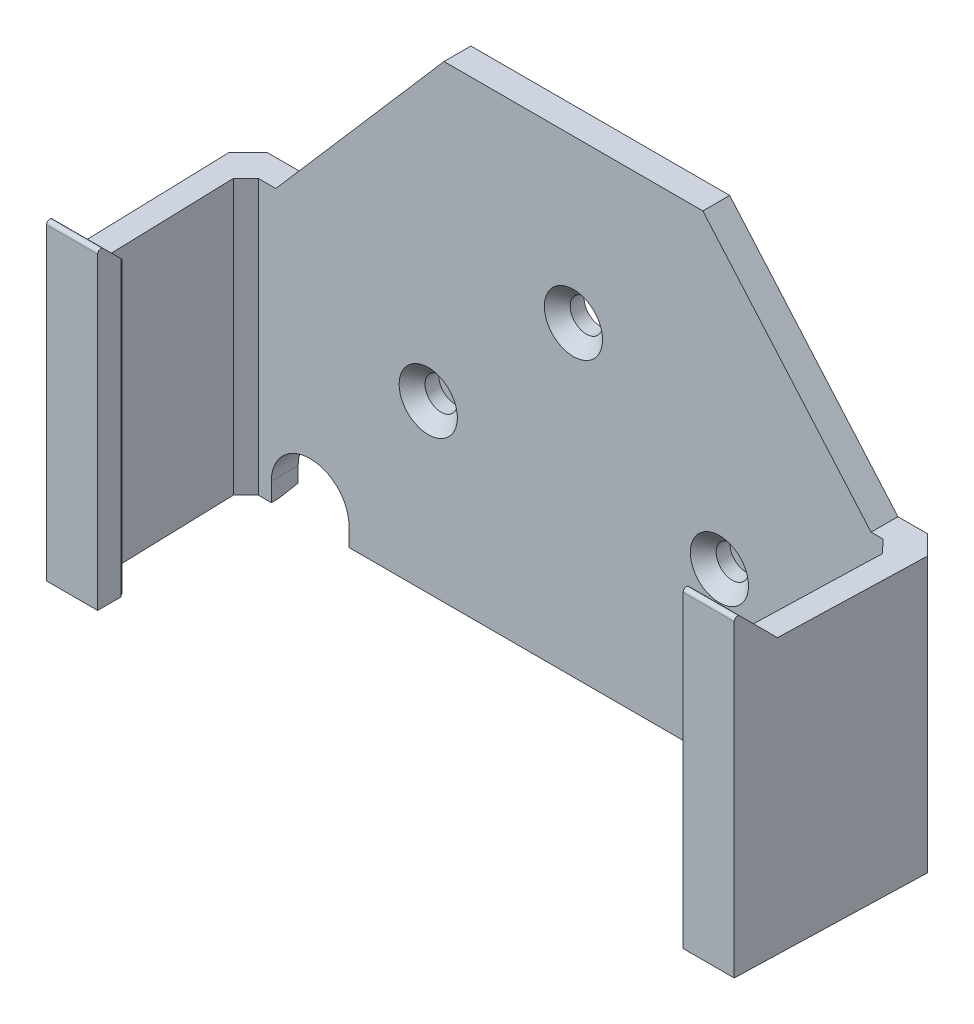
from build123d import *
from OCP.BRepFilletAPI import BRepFilletAPI_MakeChamfer

# Parameters (mm, degrees)
IZIM1_W                     = 108
IZIM1_H                     = 48
Y_KSEKLIK_EKSTR_ZYON1_DEPTH = 32
KES_EKSTR_ZYON1_DEPTH       = 119
PAH1_SIZE                   = 3
KES_EKSTR_ZYON2_DEPTH       = 116
RADYUS2_R                   = 0.5
KES_EKSTR_ZYON4_DEPTH       = 50
KES_EKSTR_ZYON5_DEPTH       = 4.25
IZIM8_R                     = 2.5
KES_EKSTR_ZYON6_DEPTH       = 10
PAH2_SIZE                   = 2
RADYUS4_R                   = 0.2
Y_KSEKLIK_EKSTR_ZYON2_START = 9
IZIM9_W                     = 69
IZIM9_H                     = 4.149898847
Y_KSEKLIK_EKSTR_ZYON2_DEPTH = 9
PAH3_SIZE                   = 2
PAH3_SIZE2                  = 1.943125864
Y_KSEKLIK_EKSTR_ZYON3_DEPTH = 4.149898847
IZIM11_R                    = 2.5
KES_EKSTR_ZYON7_DEPTH       = 9
PAH4_SIZE                   = 2
IZIM12_W                    = 20
IZIM12_H                    = 65.055548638
Y_KSEKLIK_EKSTR_ZYON4_DEPTH = 25
RADYUS5_R                   = 1
Y_KSEKLIK_EKSTR_ZYON6_START = 6
Y_KSEKLIK_EKSTR_ZYON6_DEPTH = 6
KES_EKSTR_ZYON10_DEPTH      = 94.5
KES_EKSTR_ZYON11_DEPTH      = 94.5
KES_EKSTR_ZYON12_DEPTH      = 189.5
KES_EKSTR_ZYON13_DEPTH      = 189.5


with BuildPart() as part:
    # izim1 → Y_kseklik-Ekstr_zyon1 (new body)
    with BuildSketch(Plane.XY):
        with Locations((54, 24)):
            Rectangle(IZIM1_W, IZIM1_H)
    extrude(amount=Y_KSEKLIK_EKSTR_ZYON1_DEPTH)

    # izim2 → Kes-Ekstr_zyon1 (cut)
    with BuildSketch(Plane(origin=(0, 48, 0), x_dir=(1, 0, 0), z_dir=(0, 1, 0))):
        Polygon((8.75, -32), (99.25, -32), (99.25, -28.42558078), (99.75, -27.699898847), (103.55, -27.699898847), (104.25, -4.149898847), (3.75, -4.149898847), (4.45, -27.699898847), (8.25, -27.699898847), (8.75, -28.42558078), align=None)
    extrude(amount=-KES_EKSTR_ZYON1_DEPTH, mode=Mode.SUBTRACT)

    # Pah1
    pah1_edges = [part.edges().sort_by_distance(p)[0] for p in [
        (108, 24, 0),
        (0, 24, 0),
    ]]
    chamfer(pah1_edges, length=PAH1_SIZE)

    # izim4 → Kes-Ekstr_zyon2 (cut)
    with BuildSketch(Plane.ZY):
        Polygon((32, 48), (25.5, 41.5), (0, 41.5), (0, 48), align=None)
    extrude(amount=-KES_EKSTR_ZYON2_DEPTH, mode=Mode.SUBTRACT)

    # Radyus2
    radyus2_edges = [part.edges().sort_by_distance(p)[0] for p in [
        (4.375, 48, 32),
        (103.625, 48, 32),
    ]]
    fillet(radyus2_edges, radius=RADYUS2_R)

    # izim6 → Kes-Ekstr_zyon4 (cut, symmetric)
    with BuildSketch(Plane(origin=(0, 41.5, 0), x_dir=(1, 0, 0), z_dir=(0, 1, 0))):
        Polygon((0, -3), (0.861995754, -32), (-3.705568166, -32), align=None)
        Polygon((111.705568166, -32), (108, -3), (107.138004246, -32), align=None)
    extrude(amount=KES_EKSTR_ZYON4_DEPTH, both=True, mode=Mode.SUBTRACT)

    # izim7 → Kes-Ekstr_zyon5 (cut)
    with BuildSketch(Plane(origin=(0, 0, 0), x_dir=(-1, 0, 0), z_dir=(0, 0, -1))):
        with BuildLine():
            Line((-100.75, 2), (-100.75, 0))
            Line((-100.75, 0), (-88.75, 0))
            Line((-88.75, 0), (-88.75, 2))
            ThreePointArc((-88.75, 2), (-94.75, 8), (-100.75, 2))
        make_face()
        with BuildLine():
            Line((-19.75, 2), (-19.75, 0))
            Line((-19.75, 0), (-7.75, 0))
            Line((-7.75, 0), (-7.75, 2))
            ThreePointArc((-7.75, 2), (-13.75, 8), (-19.75, 2))
        make_face()
    extrude(amount=-KES_EKSTR_ZYON5_DEPTH, mode=Mode.SUBTRACT)

    # izim8 → Kes-Ekstr_zyon6 (cut)
    with BuildSketch(Plane(origin=(0, 0, 0), x_dir=(-1, 0, 0), z_dir=(0, 0, -1))):
        with Locations((-77, 24.835138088)):
            Circle(IZIM8_R)
        with Locations((-32, 24.835138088)):
            Circle(IZIM8_R)
    extrude(amount=-KES_EKSTR_ZYON6_DEPTH, mode=Mode.SUBTRACT)

    # Pah2
    pah2_edges = [part.edges().sort_by_distance(p)[0] for p in [
        (79.5, 24.835138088, 4.149898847),
        (34.5, 24.835138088, 4.149898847),
    ]]
    chamfer(pah2_edges, length=PAH2_SIZE)

    # Radyus4
    radyus4_edges = [part.edges().sort_by_distance(p)[0] for p in [
        (103.55, 21.849949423, 27.699898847),
        (4.45, 21.849949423, 27.699898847),
    ]]
    fillet(radyus4_edges, radius=RADYUS4_R)

    # izim9 → Y_kseklik-Ekstr_zyon2 (add)
    with BuildSketch(Plane.XZ.offset(Y_KSEKLIK_EKSTR_ZYON2_START)):
        with BuildLine():
            Line((8.75, 32), (0.861995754, 32))
            Line((0.861995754, 32), (0, 3))
            Line((0, 3), (3, 0))
            Line((3, 0), (7.75, 0))
            Line((7.75, 0), (7.75, 4.149898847))
            Line((7.75, 4.149898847), (3.75, 4.149898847))
            Line((3.75, 4.149898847), (4.444231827, 27.505841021))
            ThreePointArc((4.444231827, 27.505841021), (4.504838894, 27.643405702), (4.644143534, 27.699898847))
            Line((4.644143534, 27.699898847), (8.25, 27.699898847))
            Line((8.25, 27.699898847), (8.75, 28.42558078))
            Line((8.75, 28.42558078), (8.75, 32))
        make_face()
        with Locations((54.25, 2.074949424)):
            Rectangle(IZIM9_W, IZIM9_H)
        with BuildLine():
            Line((104.25, 4.149898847), (100.75, 4.149898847))
            Line((100.75, 4.149898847), (100.75, 0))
            Line((100.75, 0), (105, 0))
            Line((105, 0), (108, 3))
            Line((108, 3), (107.138004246, 32))
            Line((107.138004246, 32), (99.25, 32))
            Line((99.25, 32), (99.25, 28.42558078))
            Line((99.25, 28.42558078), (99.75, 27.699898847))
            Line((99.75, 27.699898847), (103.355856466, 27.699898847))
            ThreePointArc((103.355856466, 27.699898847), (103.495161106, 27.643405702), (103.555768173, 27.505841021))
            Line((103.555768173, 27.505841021), (104.234696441, 4.664754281))
            Line((104.234696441, 4.664754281), (104.25, 4.149898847))
        make_face()
    extrude(amount=-Y_KSEKLIK_EKSTR_ZYON2_DEPTH)

    # Pah3: one chamfer whose edges measure the first distance from different faces: ONE call of the kernel's chamfer builder (chamfer() names one face for all edges)
    pah3_edges_1 = [part.edges().sort_by_distance(p)[0] for p in [
        (3.75, 16.25, 4.149898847),
    ]]
    pah3_side_1 = [part.faces().sort_by_distance(p)[0] for p in [
        (53.965457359, 17.441294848, 4.149898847),
    ]]
    pah3_edges_2 = [part.edges().sort_by_distance(p)[0] for p in [
        (104.25, 20.75, 4.149898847),
    ]]
    pah3_side_2 = [part.faces().sort_by_distance(p)[0] for p in [
        (103.900988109, 16.376005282, 15.891656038),
    ]]
    pah3 = BRepFilletAPI_MakeChamfer(part.part.solid().wrapped)
    for e in pah3_edges_1:
        pah3.Add(PAH3_SIZE, PAH3_SIZE2, e.wrapped, pah3_side_1[0].wrapped)  # the first distance lies on this face
    for e in pah3_edges_2:
        pah3.Add(PAH3_SIZE, PAH3_SIZE2, e.wrapped, pah3_side_2[0].wrapped)  # the first distance lies on this face
    add(Compound.cast(pah3.Shape()), mode=Mode.REPLACE)

    # izim10 → Y_kseklik-Ekstr_zyon3 (add)
    with BuildSketch(Plane(origin=(0, 0, 0), x_dir=(-1, 0, 0), z_dir=(0, 0, -1))):
        Polygon((-100.440578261, 41.5), (-74.440578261, 71.5), (-34.440578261, 71.5), (-8.440578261, 41.5), align=None)
    extrude(amount=-Y_KSEKLIK_EKSTR_ZYON3_DEPTH)

    # izim11 → Kes-Ekstr_zyon7 (cut)
    with BuildSketch(Plane.XY.offset(4.149898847)):
        with Locations((54.440578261, 46.5)):
            Circle(IZIM11_R)
    extrude(amount=-KES_EKSTR_ZYON7_DEPTH, mode=Mode.SUBTRACT)

    # Pah4
    pah4_edges = [part.edges().sort_by_distance(p)[0] for p in [
        (51.940578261, 46.5, 4.149898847),
    ]]
    chamfer(pah4_edges, length=PAH4_SIZE)

    # izim12 → Y_kseklik-Ekstr_zyon4 (add)
    with BuildSketch(Plane(origin=(0, 0, 0), x_dir=(-1, 0, 0), z_dir=(0, 0, -1))):
        with Locations((-74.440578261, 23.527774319)):
            Rectangle(IZIM12_W, IZIM12_H)
        with Locations((-34.440578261, 23.527774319)):
            Rectangle(IZIM12_W, IZIM12_H)
    extrude(amount=Y_KSEKLIK_EKSTR_ZYON4_DEPTH)

    # Radyus5
    radyus5_edges = [part.edges().sort_by_distance(p)[0] for p in [
        (64.440578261, 23.527774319, 0),
        (84.440578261, 23.527774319, 0),
        (44.440578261, 23.527774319, 0),
        (24.440578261, 23.527774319, 0),
    ]]
    fillet(radyus5_edges, radius=RADYUS5_R)

    # izim13 → Y_kseklik-Ekstr_zyon6 (add)
    with BuildSketch(Plane.XZ.offset(9).offset(Y_KSEKLIK_EKSTR_ZYON6_START)):
        with BuildLine():
            Line((88.75, 0), (88.75, 4.149898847))
            Line((88.75, 4.149898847), (19.75, 4.149898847))
            Line((19.75, 4.149898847), (19.75, 0))
            Line((19.75, 0), (23.440578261, 0))
            ThreePointArc((23.440578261, 0), (24.147685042, -0.292893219), (24.440578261, -1))
            Line((24.440578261, -1), (24.440578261, -25))
            Line((24.440578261, -25), (44.440578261, -25))
            Line((44.440578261, -25), (44.440578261, -1))
            ThreePointArc((44.440578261, -1), (44.73347148, -0.292893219), (45.440578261, 0))
            Line((45.440578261, 0), (63.440578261, 0))
            ThreePointArc((63.440578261, 0), (64.147685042, -0.292893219), (64.440578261, -1))
            Line((64.440578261, -1), (64.440578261, -25))
            Line((64.440578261, -25), (84.440578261, -25))
            Line((84.440578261, -25), (84.440578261, -1))
            ThreePointArc((84.440578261, -1), (84.73347148, -0.292893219), (85.440578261, 0))
            Line((85.440578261, 0), (88.75, 0))
        make_face()
        with BuildLine():
            Line((4.644143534, 27.699898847), (8.25, 27.699898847))
            Line((8.25, 27.699898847), (8.75, 28.42558078))
            Line((8.75, 28.42558078), (8.75, 32))
            Line((8.75, 32), (0.861995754, 32))
            Line((0.861995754, 32), (0, 3))
            Line((0, 3), (3, 0))
            Line((3, 0), (7.75, 0))
            Line((7.75, 0), (7.75, 4.149898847))
            Line((7.75, 4.149898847), (5.75, 4.149898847))
            Line((5.75, 4.149898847), (3.807731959, 6.092166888))
            Line((3.807731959, 6.092166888), (4.444231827, 27.505841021))
            ThreePointArc((4.444231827, 27.505841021), (4.504838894, 27.643405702), (4.644143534, 27.699898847))
        make_face()
        with BuildLine():
            Line((99.75, 27.699898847), (103.355856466, 27.699898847))
            ThreePointArc((103.355856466, 27.699898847), (103.495161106, 27.643405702), (103.555768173, 27.505841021))
            Line((103.555768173, 27.505841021), (104.190578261, 6.149015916))
            Line((104.190578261, 6.149015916), (102.306874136, 4.149898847))
            Line((102.306874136, 4.149898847), (100.75, 4.149898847))
            Line((100.75, 4.149898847), (100.75, 0))
            Line((100.75, 0), (105, 0))
            Line((105, 0), (108, 3))
            Line((108, 3), (107.138004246, 32))
            Line((107.138004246, 32), (99.25, 32))
            Line((99.25, 32), (99.25, 28.42558078))
            Line((99.25, 28.42558078), (99.75, 27.699898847))
        make_face()
    extrude(amount=-Y_KSEKLIK_EKSTR_ZYON6_DEPTH)

    # izim14 → Kes-Ekstr_zyon10 (cut, symmetric)
    with BuildSketch(Plane(origin=(84.440578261, 0, 0), x_dir=(0, 0, -1), z_dir=(1, 0, 0))):
        Polygon((25, -15), (0, 56.055548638), (25, 56.055548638), align=None)
    extrude(amount=KES_EKSTR_ZYON10_DEPTH, both=True, mode=Mode.SUBTRACT)

    # izim15 → Kes-Ekstr_zyon11 (cut, symmetric)
    with BuildSketch(Plane(origin=(84.440578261, 0, 0), x_dir=(0, 0, -1), z_dir=(1, 0, 0))):
        Polygon((-32, -15), (23.06489426, -9.5), (25, -15), align=None)
    extrude(amount=KES_EKSTR_ZYON11_DEPTH, both=True, mode=Mode.SUBTRACT)

    # izim16 → Kes-Ekstr_zyon12 (cut, symmetric)
    with BuildSketch(Plane(origin=(-0.089093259, 0, 0.002648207), x_dir=(0.0297108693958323, 0, 0.9995585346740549), z_dir=(-0.9995585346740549, 0, 0.0297108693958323))):
        Polygon((2.998675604, -0.9), (0.089132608, -0.9), (0.089132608, -15.376463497), (43.606407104, -19.918996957), (52.011246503, -0.9), align=None)
    extrude(amount=KES_EKSTR_ZYON12_DEPTH, both=True, mode=Mode.SUBTRACT)

    # izim18 → Kes-Ekstr_zyon13 (cut, symmetric)
    with BuildSketch(Plane(origin=(84.440578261, 0, 0), x_dir=(0, 0, -1), z_dir=(1, 0, 0))):
        Polygon((18.63174293, 3.1), (31.009552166, -13.900855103), (-2.719324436, -12.283421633), (-3, -0.9), align=None)
    extrude(amount=KES_EKSTR_ZYON13_DEPTH, both=True, mode=Mode.SUBTRACT)


solid = part.part
